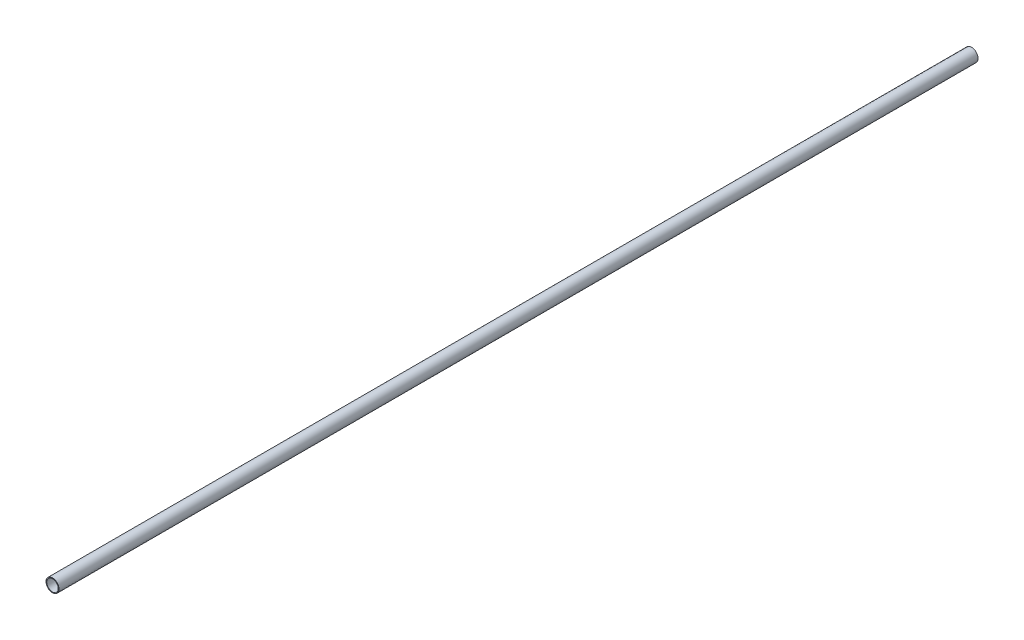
ISO-10303-21;
HEADER;
FILE_DESCRIPTION(('STEP AP214'),'2;1');
FILE_NAME('part.step','',(''),(''),'','','');
FILE_SCHEMA(('AUTOMOTIVE_DESIGN { 1 0 10303 214 1 1 1 1 }'));
ENDSEC;
DATA;
#1=APPLICATION_CONTEXT('core data for automotive mechanical design processes');
#2=APPLICATION_PROTOCOL_DEFINITION('international standard','automotive_design',2000,#1);
#3=PRODUCT_CONTEXT('',#1,'mechanical');
#4=PRODUCT('Part','Part','',(#3));
#5=PRODUCT_RELATED_PRODUCT_CATEGORY('part','',(#4));
#6=PRODUCT_DEFINITION_FORMATION('','',#4);
#7=PRODUCT_DEFINITION_CONTEXT('part definition',#1,'design');
#8=PRODUCT_DEFINITION('design','',#6,#7);
#9=PRODUCT_DEFINITION_SHAPE('','',#8);
#10=(LENGTH_UNIT() NAMED_UNIT(*) SI_UNIT(.MILLI.,.METRE.));
#11=(NAMED_UNIT(*) PLANE_ANGLE_UNIT() SI_UNIT($,.RADIAN.));
#12=(NAMED_UNIT(*) SI_UNIT($,.STERADIAN.) SOLID_ANGLE_UNIT());
#13=UNCERTAINTY_MEASURE_WITH_UNIT(LENGTH_MEASURE(1.E-05),#10,'distance_accuracy_value','');
#14=(GEOMETRIC_REPRESENTATION_CONTEXT(3) GLOBAL_UNCERTAINTY_ASSIGNED_CONTEXT((#13)) GLOBAL_UNIT_ASSIGNED_CONTEXT((#10,
#11,#12)) REPRESENTATION_CONTEXT('',''));
#15=CARTESIAN_POINT('',(0.,0.,0.));
#16=DIRECTION('',(0.,0.,1.));
#17=DIRECTION('',(1.,0.,0.));
#18=AXIS2_PLACEMENT_3D('',#15,#16,#17);
#19=CARTESIAN_POINT('',(0.,0.,1990.));
#20=DIRECTION('',(0.,0.,1.));
#21=DIRECTION('',(1.,0.,0.));
#22=AXIS2_PLACEMENT_3D('',#19,#20,#21);
#23=PLANE('',#22);
#24=CARTESIAN_POINT('',(0.,0.,1990.));
#25=DIRECTION('',(0.,0.,1.));
#26=DIRECTION('',(1.,0.,0.));
#27=AXIS2_PLACEMENT_3D('',#24,#25,#26);
#28=CIRCLE('',#27,14.0431526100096);
#29=CARTESIAN_POINT('',(-14.0431526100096,0.,1990.));
#30=VERTEX_POINT('',#29);
#31=EDGE_CURVE('E11',#30,#30,#28,.T.);
#32=ORIENTED_EDGE('',*,*,#31,.T.);
#33=EDGE_LOOP('',(#32));
#34=FACE_BOUND('',#33,.T.);
#35=CARTESIAN_POINT('',(0.,0.,1990.));
#36=DIRECTION('',(0.,0.,1.));
#37=DIRECTION('',(1.,0.,0.));
#38=AXIS2_PLACEMENT_3D('',#35,#36,#37);
#39=CIRCLE('',#38,12.5);
#40=CARTESIAN_POINT('',(-12.5,0.,1990.));
#41=VERTEX_POINT('',#40);
#42=EDGE_CURVE('E45',#41,#41,#39,.T.);
#43=ORIENTED_EDGE('',*,*,#42,.F.);
#44=EDGE_LOOP('',(#43));
#45=FACE_BOUND('',#44,.T.);
#46=ADVANCED_FACE('F34',(#34,#45),#23,.T.);
#47=CARTESIAN_POINT('',(0.,0.,0.));
#48=DIRECTION('',(0.,0.,1.));
#49=DIRECTION('',(1.,0.,0.));
#50=AXIS2_PLACEMENT_3D('',#47,#48,#49);
#51=PLANE('',#50);
#52=CARTESIAN_POINT('',(0.,0.,0.));
#53=DIRECTION('',(0.,0.,1.));
#54=DIRECTION('',(1.,0.,0.));
#55=AXIS2_PLACEMENT_3D('',#52,#53,#54);
#56=CIRCLE('',#55,14.0431526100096);
#57=CARTESIAN_POINT('',(-14.0431526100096,0.,0.));
#58=VERTEX_POINT('',#57);
#59=EDGE_CURVE('E38',#58,#58,#56,.T.);
#60=ORIENTED_EDGE('',*,*,#59,.F.);
#61=EDGE_LOOP('',(#60));
#62=FACE_BOUND('',#61,.T.);
#63=CARTESIAN_POINT('',(0.,0.,0.));
#64=DIRECTION('',(0.,0.,1.));
#65=DIRECTION('',(1.,0.,0.));
#66=AXIS2_PLACEMENT_3D('',#63,#64,#65);
#67=CIRCLE('',#66,12.5);
#68=CARTESIAN_POINT('',(-12.5,0.,0.));
#69=VERTEX_POINT('',#68);
#70=EDGE_CURVE('E47',#69,#69,#67,.T.);
#71=ORIENTED_EDGE('',*,*,#70,.T.);
#72=EDGE_LOOP('',(#71));
#73=FACE_BOUND('',#72,.T.);
#74=ADVANCED_FACE('F57',(#62,#73),#51,.F.);
#75=CARTESIAN_POINT('',(0.,0.,1990.));
#76=DIRECTION('',(0.,0.,-1.));
#77=DIRECTION('',(-1.,0.,0.));
#78=AXIS2_PLACEMENT_3D('',#75,#76,#77);
#79=CYLINDRICAL_SURFACE('',#78,14.0431526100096);
#80=CARTESIAN_POINT('',(-14.0431526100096,0.,1990.));
#81=CARTESIAN_POINT('',(-14.0431526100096,0.,1969.27083333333));
#82=CARTESIAN_POINT('',(-14.0431526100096,0.,1948.54166666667));
#83=CARTESIAN_POINT('',(-14.0431526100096,0.,1907.08333333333));
#84=CARTESIAN_POINT('',(-14.0431526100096,0.,1886.35416666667));
#85=CARTESIAN_POINT('',(-14.0431526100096,0.,1844.89583333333));
#86=CARTESIAN_POINT('',(-14.0431526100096,0.,1824.16666666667));
#87=CARTESIAN_POINT('',(-14.0431526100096,0.,1782.70833333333));
#88=CARTESIAN_POINT('',(-14.0431526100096,0.,1761.97916666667));
#89=CARTESIAN_POINT('',(-14.0431526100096,0.,1720.52083333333));
#90=CARTESIAN_POINT('',(-14.0431526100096,0.,1699.79166666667));
#91=CARTESIAN_POINT('',(-14.0431526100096,0.,1658.33333333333));
#92=CARTESIAN_POINT('',(-14.0431526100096,0.,1637.60416666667));
#93=CARTESIAN_POINT('',(-14.0431526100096,0.,1596.14583333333));
#94=CARTESIAN_POINT('',(-14.0431526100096,0.,1575.41666666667));
#95=CARTESIAN_POINT('',(-14.0431526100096,0.,1533.95833333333));
#96=CARTESIAN_POINT('',(-14.0431526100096,0.,1513.22916666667));
#97=CARTESIAN_POINT('',(-14.0431526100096,0.,1471.77083333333));
#98=CARTESIAN_POINT('',(-14.0431526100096,0.,1451.04166666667));
#99=CARTESIAN_POINT('',(-14.0431526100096,0.,1409.58333333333));
#100=CARTESIAN_POINT('',(-14.0431526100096,0.,1388.85416666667));
#101=CARTESIAN_POINT('',(-14.0431526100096,0.,1347.39583333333));
#102=CARTESIAN_POINT('',(-14.0431526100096,0.,1326.66666666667));
#103=CARTESIAN_POINT('',(-14.0431526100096,0.,1285.20833333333));
#104=CARTESIAN_POINT('',(-14.0431526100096,0.,1264.47916666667));
#105=CARTESIAN_POINT('',(-14.0431526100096,0.,1223.02083333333));
#106=CARTESIAN_POINT('',(-14.0431526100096,0.,1202.29166666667));
#107=CARTESIAN_POINT('',(-14.0431526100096,0.,1160.83333333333));
#108=CARTESIAN_POINT('',(-14.0431526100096,0.,1140.10416666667));
#109=CARTESIAN_POINT('',(-14.0431526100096,0.,1098.64583333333));
#110=CARTESIAN_POINT('',(-14.0431526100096,0.,1077.91666666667));
#111=CARTESIAN_POINT('',(-14.0431526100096,0.,1036.45833333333));
#112=CARTESIAN_POINT('',(-14.0431526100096,0.,1015.72916666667));
#113=CARTESIAN_POINT('',(-14.0431526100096,0.,974.270833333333));
#114=CARTESIAN_POINT('',(-14.0431526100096,0.,953.541666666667));
#115=CARTESIAN_POINT('',(-14.0431526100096,0.,912.083333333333));
#116=CARTESIAN_POINT('',(-14.0431526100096,0.,891.354166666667));
#117=CARTESIAN_POINT('',(-14.0431526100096,0.,849.895833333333));
#118=CARTESIAN_POINT('',(-14.0431526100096,0.,829.166666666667));
#119=CARTESIAN_POINT('',(-14.0431526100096,0.,787.708333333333));
#120=CARTESIAN_POINT('',(-14.0431526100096,0.,766.979166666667));
#121=CARTESIAN_POINT('',(-14.0431526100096,0.,725.520833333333));
#122=CARTESIAN_POINT('',(-14.0431526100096,0.,704.791666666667));
#123=CARTESIAN_POINT('',(-14.0431526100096,0.,663.333333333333));
#124=CARTESIAN_POINT('',(-14.0431526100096,0.,642.604166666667));
#125=CARTESIAN_POINT('',(-14.0431526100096,0.,601.145833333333));
#126=CARTESIAN_POINT('',(-14.0431526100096,0.,580.416666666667));
#127=CARTESIAN_POINT('',(-14.0431526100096,0.,538.958333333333));
#128=CARTESIAN_POINT('',(-14.0431526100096,0.,518.229166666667));
#129=CARTESIAN_POINT('',(-14.0431526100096,0.,476.770833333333));
#130=CARTESIAN_POINT('',(-14.0431526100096,0.,456.041666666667));
#131=CARTESIAN_POINT('',(-14.0431526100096,0.,414.583333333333));
#132=CARTESIAN_POINT('',(-14.0431526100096,0.,393.854166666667));
#133=CARTESIAN_POINT('',(-14.0431526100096,0.,352.395833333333));
#134=CARTESIAN_POINT('',(-14.0431526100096,0.,331.666666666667));
#135=CARTESIAN_POINT('',(-14.0431526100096,0.,290.208333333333));
#136=CARTESIAN_POINT('',(-14.0431526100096,0.,269.479166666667));
#137=CARTESIAN_POINT('',(-14.0431526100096,0.,228.020833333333));
#138=CARTESIAN_POINT('',(-14.0431526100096,0.,207.291666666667));
#139=CARTESIAN_POINT('',(-14.0431526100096,0.,165.833333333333));
#140=CARTESIAN_POINT('',(-14.0431526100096,0.,145.104166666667));
#141=CARTESIAN_POINT('',(-14.0431526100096,0.,103.645833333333));
#142=CARTESIAN_POINT('',(-14.0431526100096,0.,82.9166666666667));
#143=CARTESIAN_POINT('',(-14.0431526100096,0.,41.4583333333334));
#144=CARTESIAN_POINT('',(-14.0431526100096,0.,20.7291666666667));
#145=CARTESIAN_POINT('',(-14.0431526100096,0.,0.));
#146=B_SPLINE_CURVE_WITH_KNOTS('',3,(#80,#81,#82,#83,#84,#85,#86,#87,#88,#89,#90,#91,#92,#93,
#94,#95,#96,#97,#98,#99,#100,#101,#102,#103,#104,#105,#106,#107,#108,#109,#110,#111,#112,#113,
#114,#115,#116,#117,#118,#119,#120,#121,#122,#123,#124,#125,#126,#127,#128,#129,#130,#131,#132,
#133,#134,#135,#136,#137,#138,#139,#140,#141,#142,#143,#144,#145),.UNSPECIFIED.,.F.,.F.,(4,2,2,
2,2,2,2,2,2,2,2,2,2,2,2,2,2,2,2,2,2,2,2,2,2,2,2,2,2,2,2,2,4),(0.,62.1875000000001,124.375,
186.5625,248.75,310.9375,373.125,435.3125,497.5,559.6875,621.875,684.0625,746.25,808.4375,
870.625,932.8125,995.,1057.1875,1119.375,1181.5625,1243.75,1305.9375,1368.125,1430.3125,1492.5,
1554.6875,1616.875,1679.0625,1741.25,1803.4375,1865.625,1927.8125,1990.),.UNSPECIFIED.);
#147=EDGE_CURVE('BSEAM36',#30,#58,#146,.T.);
#148=ORIENTED_EDGE('',*,*,#31,.F.);
#149=ORIENTED_EDGE('',*,*,#59,.T.);
#150=ORIENTED_EDGE('',*,*,#147,.T.);
#151=ORIENTED_EDGE('',*,*,#147,.F.);
#152=EDGE_LOOP('',(#148,#150,#149,#151));
#153=FACE_BOUND('',#152,.T.);
#154=ADVANCED_FACE('F36',(#153),#79,.T.);
#155=CARTESIAN_POINT('',(0.,0.,1990.));
#156=DIRECTION('',(0.,0.,-1.));
#157=DIRECTION('',(-1.,0.,0.));
#158=AXIS2_PLACEMENT_3D('',#155,#156,#157);
#159=CYLINDRICAL_SURFACE('',#158,12.5);
#160=CARTESIAN_POINT('',(-12.5,0.,1990.));
#161=CARTESIAN_POINT('',(-12.5,0.,1969.27083333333));
#162=CARTESIAN_POINT('',(-12.5,0.,1948.54166666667));
#163=CARTESIAN_POINT('',(-12.5,0.,1907.08333333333));
#164=CARTESIAN_POINT('',(-12.5,0.,1886.35416666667));
#165=CARTESIAN_POINT('',(-12.5,0.,1844.89583333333));
#166=CARTESIAN_POINT('',(-12.5,0.,1824.16666666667));
#167=CARTESIAN_POINT('',(-12.5,0.,1782.70833333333));
#168=CARTESIAN_POINT('',(-12.5,0.,1761.97916666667));
#169=CARTESIAN_POINT('',(-12.5,0.,1720.52083333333));
#170=CARTESIAN_POINT('',(-12.5,0.,1699.79166666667));
#171=CARTESIAN_POINT('',(-12.5,0.,1658.33333333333));
#172=CARTESIAN_POINT('',(-12.5,0.,1637.60416666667));
#173=CARTESIAN_POINT('',(-12.5,0.,1596.14583333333));
#174=CARTESIAN_POINT('',(-12.5,0.,1575.41666666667));
#175=CARTESIAN_POINT('',(-12.5,0.,1533.95833333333));
#176=CARTESIAN_POINT('',(-12.5,0.,1513.22916666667));
#177=CARTESIAN_POINT('',(-12.5,0.,1471.77083333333));
#178=CARTESIAN_POINT('',(-12.5,0.,1451.04166666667));
#179=CARTESIAN_POINT('',(-12.5,0.,1409.58333333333));
#180=CARTESIAN_POINT('',(-12.5,0.,1388.85416666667));
#181=CARTESIAN_POINT('',(-12.5,0.,1347.39583333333));
#182=CARTESIAN_POINT('',(-12.5,0.,1326.66666666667));
#183=CARTESIAN_POINT('',(-12.5,0.,1285.20833333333));
#184=CARTESIAN_POINT('',(-12.5,0.,1264.47916666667));
#185=CARTESIAN_POINT('',(-12.5,0.,1223.02083333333));
#186=CARTESIAN_POINT('',(-12.5,0.,1202.29166666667));
#187=CARTESIAN_POINT('',(-12.5,0.,1160.83333333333));
#188=CARTESIAN_POINT('',(-12.5,0.,1140.10416666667));
#189=CARTESIAN_POINT('',(-12.5,0.,1098.64583333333));
#190=CARTESIAN_POINT('',(-12.5,0.,1077.91666666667));
#191=CARTESIAN_POINT('',(-12.5,0.,1036.45833333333));
#192=CARTESIAN_POINT('',(-12.5,0.,1015.72916666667));
#193=CARTESIAN_POINT('',(-12.5,0.,974.270833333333));
#194=CARTESIAN_POINT('',(-12.5,0.,953.541666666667));
#195=CARTESIAN_POINT('',(-12.5,0.,912.083333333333));
#196=CARTESIAN_POINT('',(-12.5,0.,891.354166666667));
#197=CARTESIAN_POINT('',(-12.5,0.,849.895833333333));
#198=CARTESIAN_POINT('',(-12.5,0.,829.166666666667));
#199=CARTESIAN_POINT('',(-12.5,0.,787.708333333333));
#200=CARTESIAN_POINT('',(-12.5,0.,766.979166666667));
#201=CARTESIAN_POINT('',(-12.5,0.,725.520833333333));
#202=CARTESIAN_POINT('',(-12.5,0.,704.791666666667));
#203=CARTESIAN_POINT('',(-12.5,0.,663.333333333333));
#204=CARTESIAN_POINT('',(-12.5,0.,642.604166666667));
#205=CARTESIAN_POINT('',(-12.5,0.,601.145833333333));
#206=CARTESIAN_POINT('',(-12.5,0.,580.416666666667));
#207=CARTESIAN_POINT('',(-12.5,0.,538.958333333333));
#208=CARTESIAN_POINT('',(-12.5,0.,518.229166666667));
#209=CARTESIAN_POINT('',(-12.5,0.,476.770833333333));
#210=CARTESIAN_POINT('',(-12.5,0.,456.041666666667));
#211=CARTESIAN_POINT('',(-12.5,0.,414.583333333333));
#212=CARTESIAN_POINT('',(-12.5,0.,393.854166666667));
#213=CARTESIAN_POINT('',(-12.5,0.,352.395833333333));
#214=CARTESIAN_POINT('',(-12.5,0.,331.666666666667));
#215=CARTESIAN_POINT('',(-12.5,0.,290.208333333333));
#216=CARTESIAN_POINT('',(-12.5,0.,269.479166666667));
#217=CARTESIAN_POINT('',(-12.5,0.,228.020833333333));
#218=CARTESIAN_POINT('',(-12.5,0.,207.291666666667));
#219=CARTESIAN_POINT('',(-12.5,0.,165.833333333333));
#220=CARTESIAN_POINT('',(-12.5,0.,145.104166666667));
#221=CARTESIAN_POINT('',(-12.5,0.,103.645833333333));
#222=CARTESIAN_POINT('',(-12.5,0.,82.9166666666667));
#223=CARTESIAN_POINT('',(-12.5,0.,41.4583333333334));
#224=CARTESIAN_POINT('',(-12.5,0.,20.7291666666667));
#225=CARTESIAN_POINT('',(-12.5,0.,0.));
#226=B_SPLINE_CURVE_WITH_KNOTS('',3,(#160,#161,#162,#163,#164,#165,#166,#167,#168,#169,#170,
#171,#172,#173,#174,#175,#176,#177,#178,#179,#180,#181,#182,#183,#184,#185,#186,#187,#188,#189,
#190,#191,#192,#193,#194,#195,#196,#197,#198,#199,#200,#201,#202,#203,#204,#205,#206,#207,#208,
#209,#210,#211,#212,#213,#214,#215,#216,#217,#218,#219,#220,#221,#222,#223,#224,#225),
.UNSPECIFIED.,.F.,.F.,(4,2,2,2,2,2,2,2,2,2,2,2,2,2,2,2,2,2,2,2,2,2,2,2,2,2,2,2,2,2,2,2,4),(0.,
62.1875000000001,124.375,186.5625,248.75,310.9375,373.125,435.3125,497.5,559.6875,621.875,
684.0625,746.25,808.4375,870.625,932.8125,995.,1057.1875,1119.375,1181.5625,1243.75,1305.9375,
1368.125,1430.3125,1492.5,1554.6875,1616.875,1679.0625,1741.25,1803.4375,1865.625,1927.8125,
1990.),.UNSPECIFIED.);
#227=EDGE_CURVE('BSEAM53',#41,#69,#226,.T.);
#228=ORIENTED_EDGE('',*,*,#42,.T.);
#229=ORIENTED_EDGE('',*,*,#70,.F.);
#230=ORIENTED_EDGE('',*,*,#227,.T.);
#231=ORIENTED_EDGE('',*,*,#227,.F.);
#232=EDGE_LOOP('',(#228,#230,#229,#231));
#233=FACE_BOUND('',#232,.T.);
#234=ADVANCED_FACE('F53',(#233),#159,.F.);
#235=CLOSED_SHELL('',(#46,#74,#154,#234));
#236=MANIFOLD_SOLID_BREP('B2',#235);
#237=ADVANCED_BREP_SHAPE_REPRESENTATION('',(#18,#236),#14);
#238=SHAPE_DEFINITION_REPRESENTATION(#9,#237);
ENDSEC;
END-ISO-10303-21;
